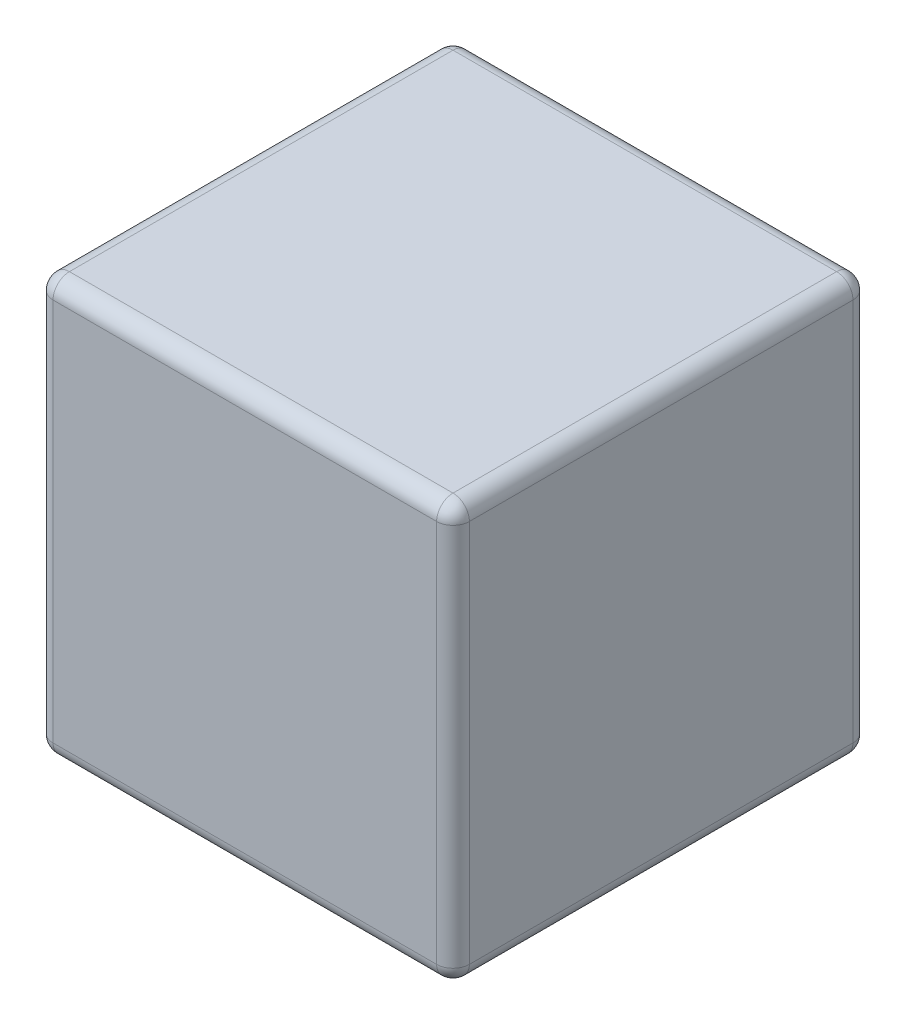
from build123d import *

# Parameters (mm, degrees)
SKETCH1_W           = 25.4
SKETCH1_H           = 25.4
BOSS_EXTRUDE1_DEPTH = 25.4
FILLET1_R           = 1


with BuildPart() as part:
    # Sketch1 → Boss-Extrude1 (new body)
    with BuildSketch(Plane(origin=(0, 0, 0), x_dir=(1, 0, 0), z_dir=(0, 1, 0))):
        Rectangle(SKETCH1_W, SKETCH1_H)
    extrude(amount=BOSS_EXTRUDE1_DEPTH)

    # Fillet1
    fillet1_edges = [part.edges().sort_by_distance(p)[0] for p in [
        (-12.7, 25.4, 0),
        (0, 25.4, 12.7),
        (12.7, 25.4, 0),
        (0, 0, 12.7),
        (-12.7, 0, 0),
        (0, 0, -12.7),
        (12.7, 0, 0),
        (12.7, 12.7, 12.7),
        (-12.7, 12.7, 12.7),
        (-12.7, 12.7, -12.7),
        (12.7, 12.7, -12.7),
        (0, 25.4, -12.7),
    ]]
    fillet(fillet1_edges, radius=FILLET1_R)


solid = part.part
